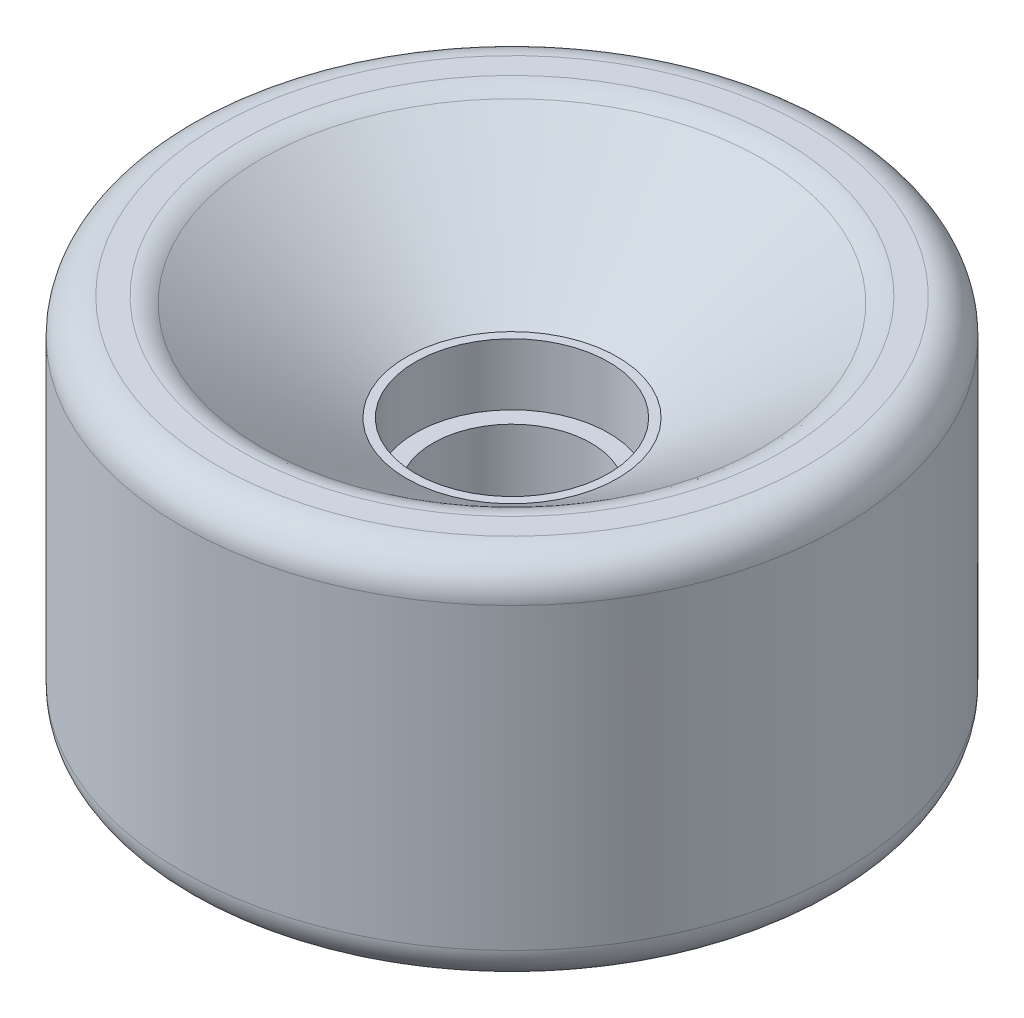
ISO-10303-21;
HEADER;
FILE_DESCRIPTION(('STEP AP214'),'2;1');
FILE_NAME('part.step','',(''),(''),'','','');
FILE_SCHEMA(('AUTOMOTIVE_DESIGN { 1 0 10303 214 1 1 1 1 }'));
ENDSEC;
DATA;
#1=APPLICATION_CONTEXT('core data for automotive mechanical design processes');
#2=APPLICATION_PROTOCOL_DEFINITION('international standard','automotive_design',2000,#1);
#3=PRODUCT_CONTEXT('',#1,'mechanical');
#4=PRODUCT('Part','Part','',(#3));
#5=PRODUCT_RELATED_PRODUCT_CATEGORY('part','',(#4));
#6=PRODUCT_DEFINITION_FORMATION('','',#4);
#7=PRODUCT_DEFINITION_CONTEXT('part definition',#1,'design');
#8=PRODUCT_DEFINITION('design','',#6,#7);
#9=PRODUCT_DEFINITION_SHAPE('','',#8);
#10=(LENGTH_UNIT() NAMED_UNIT(*) SI_UNIT(.MILLI.,.METRE.));
#11=(NAMED_UNIT(*) PLANE_ANGLE_UNIT() SI_UNIT($,.RADIAN.));
#12=(NAMED_UNIT(*) SI_UNIT($,.STERADIAN.) SOLID_ANGLE_UNIT());
#13=UNCERTAINTY_MEASURE_WITH_UNIT(LENGTH_MEASURE(1.E-05),#10,'distance_accuracy_value','');
#14=(GEOMETRIC_REPRESENTATION_CONTEXT(3) GLOBAL_UNCERTAINTY_ASSIGNED_CONTEXT((#13)) GLOBAL_UNIT_ASSIGNED_CONTEXT((#10,
#11,#12)) REPRESENTATION_CONTEXT('',''));
#15=CARTESIAN_POINT('',(0.,0.,0.));
#16=DIRECTION('',(0.,0.,1.));
#17=DIRECTION('',(1.,0.,0.));
#18=AXIS2_PLACEMENT_3D('',#15,#16,#17);
#19=CARTESIAN_POINT('',(9.,2.,0.));
#20=DIRECTION('',(0.,-1.,0.));
#21=DIRECTION('',(0.,0.,-1.));
#22=AXIS2_PLACEMENT_3D('',#19,#20,#21);
#23=PLANE('',#22);
#24=CARTESIAN_POINT('',(0.,2.,0.));
#25=DIRECTION('',(0.,1.,0.));
#26=DIRECTION('',(0.,0.,1.));
#27=AXIS2_PLACEMENT_3D('',#24,#25,#26);
#28=CIRCLE('',#27,8.99999999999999);
#29=CARTESIAN_POINT('',(0.,2.,8.99999999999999));
#30=VERTEX_POINT('',#29);
#31=EDGE_CURVE('E64',#30,#30,#28,.T.);
#32=ORIENTED_EDGE('',*,*,#31,.F.);
#33=EDGE_LOOP('',(#32));
#34=FACE_BOUND('',#33,.T.);
#35=CARTESIAN_POINT('',(0.,2.,0.));
#36=DIRECTION('',(0.,1.,0.));
#37=DIRECTION('',(0.,0.,1.));
#38=AXIS2_PLACEMENT_3D('',#35,#36,#37);
#39=CIRCLE('',#38,11.);
#40=CARTESIAN_POINT('',(0.,2.,11.));
#41=VERTEX_POINT('',#40);
#42=EDGE_CURVE('E85',#41,#41,#39,.T.);
#43=ORIENTED_EDGE('',*,*,#42,.T.);
#44=EDGE_LOOP('',(#43));
#45=FACE_BOUND('',#44,.T.);
#46=ADVANCED_FACE('F32',(#34,#45),#23,.F.);
#47=CARTESIAN_POINT('',(0.,21.,0.));
#48=DIRECTION('',(0.,1.,0.));
#49=DIRECTION('',(0.,0.,1.));
#50=AXIS2_PLACEMENT_3D('',#47,#48,#49);
#51=CYLINDRICAL_SURFACE('',#50,8.99999999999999);
#52=CARTESIAN_POINT('',(0.,-8.,0.));
#53=DIRECTION('',(0.,1.,0.));
#54=DIRECTION('',(0.,0.,1.));
#55=AXIS2_PLACEMENT_3D('',#52,#53,#54);
#56=CIRCLE('',#55,9.);
#57=CARTESIAN_POINT('',(0.,-8.,9.));
#58=VERTEX_POINT('',#57);
#59=EDGE_CURVE('E67',#58,#58,#56,.T.);
#60=ORIENTED_EDGE('',*,*,#59,.F.);
#61=EDGE_LOOP('',(#60));
#62=FACE_BOUND('',#61,.T.);
#63=ORIENTED_EDGE('',*,*,#31,.T.);
#64=EDGE_LOOP('',(#63));
#65=FACE_BOUND('',#64,.T.);
#66=ADVANCED_FACE('F115',(#62,#65),#51,.F.);
#67=CARTESIAN_POINT('',(9.,-8.,0.));
#68=DIRECTION('',(0.,1.,0.));
#69=DIRECTION('',(0.,0.,1.));
#70=AXIS2_PLACEMENT_3D('',#67,#68,#69);
#71=PLANE('',#70);
#72=CARTESIAN_POINT('',(0.,-8.,0.));
#73=DIRECTION('',(0.,1.,0.));
#74=DIRECTION('',(0.,0.,1.));
#75=AXIS2_PLACEMENT_3D('',#72,#73,#74);
#76=CIRCLE('',#75,11.);
#77=CARTESIAN_POINT('',(0.,-8.,11.));
#78=VERTEX_POINT('',#77);
#79=EDGE_CURVE('E70',#78,#78,#76,.T.);
#80=ORIENTED_EDGE('',*,*,#79,.F.);
#81=EDGE_LOOP('',(#80));
#82=FACE_BOUND('',#81,.T.);
#83=ORIENTED_EDGE('',*,*,#59,.T.);
#84=EDGE_LOOP('',(#83));
#85=FACE_BOUND('',#84,.T.);
#86=ADVANCED_FACE('F121',(#82,#85),#71,.F.);
#87=CARTESIAN_POINT('',(0.,21.,0.));
#88=DIRECTION('',(0.,1.,0.));
#89=DIRECTION('',(0.,0.,1.));
#90=AXIS2_PLACEMENT_3D('',#87,#88,#89);
#91=CYLINDRICAL_SURFACE('',#90,11.);
#92=CARTESIAN_POINT('',(0.,-15.,0.));
#93=DIRECTION('',(0.,1.,0.));
#94=DIRECTION('',(0.,0.,1.));
#95=AXIS2_PLACEMENT_3D('',#92,#93,#94);
#96=CIRCLE('',#95,11.);
#97=CARTESIAN_POINT('',(0.,-15.,11.));
#98=VERTEX_POINT('',#97);
#99=EDGE_CURVE('E73',#98,#98,#96,.T.);
#100=ORIENTED_EDGE('',*,*,#99,.F.);
#101=EDGE_LOOP('',(#100));
#102=FACE_BOUND('',#101,.T.);
#103=ORIENTED_EDGE('',*,*,#79,.T.);
#104=EDGE_LOOP('',(#103));
#105=FACE_BOUND('',#104,.T.);
#106=ADVANCED_FACE('F159',(#102,#105),#91,.F.);
#107=CARTESIAN_POINT('',(11.,-15.,0.));
#108=DIRECTION('',(0.,1.,0.));
#109=DIRECTION('',(0.,0.,1.));
#110=AXIS2_PLACEMENT_3D('',#107,#108,#109);
#111=PLANE('',#110);
#112=CARTESIAN_POINT('',(0.,-15.,0.));
#113=DIRECTION('',(0.,1.,0.));
#114=DIRECTION('',(0.,0.,1.));
#115=AXIS2_PLACEMENT_3D('',#112,#113,#114);
#116=CIRCLE('',#115,12.);
#117=CARTESIAN_POINT('',(0.,-15.,12.));
#118=VERTEX_POINT('',#117);
#119=EDGE_CURVE('E76',#118,#118,#116,.T.);
#120=ORIENTED_EDGE('',*,*,#119,.F.);
#121=EDGE_LOOP('',(#120));
#122=FACE_BOUND('',#121,.T.);
#123=ORIENTED_EDGE('',*,*,#99,.T.);
#124=EDGE_LOOP('',(#123));
#125=FACE_BOUND('',#124,.T.);
#126=ADVANCED_FACE('F153',(#122,#125),#111,.F.);
#127=CARTESIAN_POINT('',(0.,-15.,0.));
#128=DIRECTION('',(0.,-1.,0.));
#129=DIRECTION('',(0.,0.,-1.));
#130=AXIS2_PLACEMENT_3D('',#127,#128,#129);
#131=CONICAL_SURFACE('',#130,12.,1.24049897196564);
#132=CARTESIAN_POINT('',(0.,-20.7837837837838,0.));
#133=DIRECTION('',(0.,1.,0.));
#134=DIRECTION('',(0.,0.,1.));
#135=AXIS2_PLACEMENT_3D('',#132,#133,#134);
#136=CIRCLE('',#135,28.8693693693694);
#137=CARTESIAN_POINT('',(0.,-20.7837837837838,28.8693693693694));
#138=VERTEX_POINT('',#137);
#139=EDGE_CURVE('E55',#138,#138,#136,.F.);
#140=ORIENTED_EDGE('',*,*,#139,.T.);
#141=EDGE_LOOP('',(#140));
#142=FACE_BOUND('',#141,.T.);
#143=ORIENTED_EDGE('',*,*,#119,.T.);
#144=EDGE_LOOP('',(#143));
#145=FACE_BOUND('',#144,.T.);
#146=ADVANCED_FACE('F145',(#142,#145),#131,.F.);
#147=CARTESIAN_POINT('',(29.5,-21.,0.));
#148=DIRECTION('',(0.,1.,0.));
#149=DIRECTION('',(0.,0.,1.));
#150=AXIS2_PLACEMENT_3D('',#147,#148,#149);
#151=PLANE('',#150);
#152=CARTESIAN_POINT('',(0.,-21.,0.));
#153=DIRECTION('',(0.,1.,0.));
#154=DIRECTION('',(0.,0.,1.));
#155=AXIS2_PLACEMENT_3D('',#152,#153,#154);
#156=CIRCLE('',#155,30.1666666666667);
#157=CARTESIAN_POINT('',(0.,-21.,30.1666666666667));
#158=VERTEX_POINT('',#157);
#159=EDGE_CURVE('E58',#158,#158,#156,.T.);
#160=ORIENTED_EDGE('',*,*,#159,.T.);
#161=EDGE_LOOP('',(#160));
#162=FACE_BOUND('',#161,.T.);
#163=CARTESIAN_POINT('',(0.,-21.,0.));
#164=DIRECTION('',(0.,1.,0.));
#165=DIRECTION('',(0.,0.,1.));
#166=AXIS2_PLACEMENT_3D('',#163,#164,#165);
#167=CIRCLE('',#166,33.5);
#168=CARTESIAN_POINT('',(0.,-21.,33.5));
#169=VERTEX_POINT('',#168);
#170=EDGE_CURVE('E61',#169,#169,#167,.F.);
#171=ORIENTED_EDGE('',*,*,#170,.T.);
#172=EDGE_LOOP('',(#171));
#173=FACE_BOUND('',#172,.T.);
#174=ADVANCED_FACE('F143',(#162,#173),#151,.F.);
#175=CARTESIAN_POINT('',(0.,21.,0.));
#176=DIRECTION('',(0.,1.,0.));
#177=DIRECTION('',(0.,0.,1.));
#178=AXIS2_PLACEMENT_3D('',#175,#176,#177);
#179=CYLINDRICAL_SURFACE('',#178,37.5);
#180=CARTESIAN_POINT('',(0.,-17.,0.));
#181=DIRECTION('',(0.,1.,0.));
#182=DIRECTION('',(0.,0.,1.));
#183=AXIS2_PLACEMENT_3D('',#180,#181,#182);
#184=CIRCLE('',#183,37.5);
#185=CARTESIAN_POINT('',(0.,-17.,37.5));
#186=VERTEX_POINT('',#185);
#187=EDGE_CURVE('E10',#186,#186,#184,.T.);
#188=ORIENTED_EDGE('',*,*,#187,.T.);
#189=EDGE_LOOP('',(#188));
#190=FACE_BOUND('',#189,.T.);
#191=CARTESIAN_POINT('',(0.,17.,0.));
#192=DIRECTION('',(0.,-1.,0.));
#193=DIRECTION('',(0.,0.,-1.));
#194=AXIS2_PLACEMENT_3D('',#191,#192,#193);
#195=CIRCLE('',#194,37.5);
#196=CARTESIAN_POINT('',(0.,17.,-37.5));
#197=VERTEX_POINT('',#196);
#198=EDGE_CURVE('E39',#197,#197,#195,.T.);
#199=ORIENTED_EDGE('',*,*,#198,.T.);
#200=EDGE_LOOP('',(#199));
#201=FACE_BOUND('',#200,.T.);
#202=ADVANCED_FACE('F111',(#190,#201),#179,.T.);
#203=CARTESIAN_POINT('',(37.5,21.,0.));
#204=DIRECTION('',(0.,-1.,0.));
#205=DIRECTION('',(0.,0.,-1.));
#206=AXIS2_PLACEMENT_3D('',#203,#204,#205);
#207=PLANE('',#206);
#208=CARTESIAN_POINT('',(0.,21.,0.));
#209=DIRECTION('',(0.,-1.,0.));
#210=DIRECTION('',(0.,0.,-1.));
#211=AXIS2_PLACEMENT_3D('',#208,#209,#210);
#212=CIRCLE('',#211,30.7396983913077);
#213=CARTESIAN_POINT('',(0.,21.,-30.7396983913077));
#214=VERTEX_POINT('',#213);
#215=EDGE_CURVE('E43',#214,#214,#212,.T.);
#216=ORIENTED_EDGE('',*,*,#215,.T.);
#217=EDGE_LOOP('',(#216));
#218=FACE_BOUND('',#217,.T.);
#219=CARTESIAN_POINT('',(0.,21.,0.));
#220=DIRECTION('',(0.,-1.,0.));
#221=DIRECTION('',(0.,0.,-1.));
#222=AXIS2_PLACEMENT_3D('',#219,#220,#221);
#223=CIRCLE('',#222,33.5);
#224=CARTESIAN_POINT('',(0.,21.,-33.5));
#225=VERTEX_POINT('',#224);
#226=EDGE_CURVE('E47',#225,#225,#223,.F.);
#227=ORIENTED_EDGE('',*,*,#226,.T.);
#228=EDGE_LOOP('',(#227));
#229=FACE_BOUND('',#228,.T.);
#230=ADVANCED_FACE('F105',(#218,#229),#207,.F.);
#231=CARTESIAN_POINT('',(0.,21.,0.));
#232=DIRECTION('',(0.,1.,0.));
#233=DIRECTION('',(0.,0.,1.));
#234=AXIS2_PLACEMENT_3D('',#231,#232,#233);
#235=CONICAL_SURFACE('',#234,29.5,0.969722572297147);
#236=CARTESIAN_POINT('',(0.,20.2989154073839,0.));
#237=DIRECTION('',(0.,-1.,0.));
#238=DIRECTION('',(0.,0.,-1.));
#239=AXIS2_PLACEMENT_3D('',#236,#237,#238);
#240=CIRCLE('',#239,28.4775849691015);
#241=CARTESIAN_POINT('',(0.,20.2989154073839,-28.4775849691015));
#242=VERTEX_POINT('',#241);
#243=EDGE_CURVE('E52',#242,#242,#240,.F.);
#244=ORIENTED_EDGE('',*,*,#243,.T.);
#245=EDGE_LOOP('',(#244));
#246=FACE_BOUND('',#245,.T.);
#247=CARTESIAN_POINT('',(0.,9.,0.));
#248=DIRECTION('',(0.,1.,0.));
#249=DIRECTION('',(0.,0.,1.));
#250=AXIS2_PLACEMENT_3D('',#247,#248,#249);
#251=CIRCLE('',#250,12.);
#252=CARTESIAN_POINT('',(0.,9.,12.));
#253=VERTEX_POINT('',#252);
#254=EDGE_CURVE('E79',#253,#253,#251,.T.);
#255=ORIENTED_EDGE('',*,*,#254,.F.);
#256=EDGE_LOOP('',(#255));
#257=FACE_BOUND('',#256,.T.);
#258=ADVANCED_FACE('F100',(#246,#257),#235,.F.);
#259=CARTESIAN_POINT('',(11.,9.,0.));
#260=DIRECTION('',(0.,-1.,0.));
#261=DIRECTION('',(0.,0.,-1.));
#262=AXIS2_PLACEMENT_3D('',#259,#260,#261);
#263=PLANE('',#262);
#264=CARTESIAN_POINT('',(0.,9.,0.));
#265=DIRECTION('',(0.,1.,0.));
#266=DIRECTION('',(0.,0.,1.));
#267=AXIS2_PLACEMENT_3D('',#264,#265,#266);
#268=CIRCLE('',#267,11.);
#269=CARTESIAN_POINT('',(0.,9.,11.));
#270=VERTEX_POINT('',#269);
#271=EDGE_CURVE('E82',#270,#270,#268,.T.);
#272=ORIENTED_EDGE('',*,*,#271,.F.);
#273=EDGE_LOOP('',(#272));
#274=FACE_BOUND('',#273,.T.);
#275=ORIENTED_EDGE('',*,*,#254,.T.);
#276=EDGE_LOOP('',(#275));
#277=FACE_BOUND('',#276,.T.);
#278=ADVANCED_FACE('F94',(#274,#277),#263,.F.);
#279=CARTESIAN_POINT('',(0.,21.,0.));
#280=DIRECTION('',(0.,1.,0.));
#281=DIRECTION('',(0.,0.,1.));
#282=AXIS2_PLACEMENT_3D('',#279,#280,#281);
#283=CYLINDRICAL_SURFACE('',#282,11.);
#284=ORIENTED_EDGE('',*,*,#42,.F.);
#285=EDGE_LOOP('',(#284));
#286=FACE_BOUND('',#285,.T.);
#287=ORIENTED_EDGE('',*,*,#271,.T.);
#288=EDGE_LOOP('',(#287));
#289=FACE_BOUND('',#288,.T.);
#290=ADVANCED_FACE('F90',(#286,#289),#283,.F.);
#291=CARTESIAN_POINT('',(0.,-17.,0.));
#292=DIRECTION('',(0.,1.,0.));
#293=DIRECTION('',(0.,0.,1.));
#294=AXIS2_PLACEMENT_3D('',#291,#292,#293);
#295=TOROIDAL_SURFACE('',#294,30.1666666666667,4.);
#296=ORIENTED_EDGE('',*,*,#139,.F.);
#297=EDGE_LOOP('',(#296));
#298=FACE_BOUND('',#297,.T.);
#299=ORIENTED_EDGE('',*,*,#159,.F.);
#300=EDGE_LOOP('',(#299));
#301=FACE_BOUND('',#300,.T.);
#302=ADVANCED_FACE('F93',(#298,#301),#295,.T.);
#303=CARTESIAN_POINT('',(0.,17.,0.));
#304=DIRECTION('',(0.,-1.,0.));
#305=DIRECTION('',(0.,0.,-1.));
#306=AXIS2_PLACEMENT_3D('',#303,#304,#305);
#307=TOROIDAL_SURFACE('',#306,30.7396983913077,4.);
#308=ORIENTED_EDGE('',*,*,#215,.F.);
#309=EDGE_LOOP('',(#308));
#310=FACE_BOUND('',#309,.T.);
#311=ORIENTED_EDGE('',*,*,#243,.F.);
#312=EDGE_LOOP('',(#311));
#313=FACE_BOUND('',#312,.T.);
#314=ADVANCED_FACE('F129',(#310,#313),#307,.T.);
#315=CARTESIAN_POINT('',(0.,-17.,0.));
#316=DIRECTION('',(0.,1.,0.));
#317=DIRECTION('',(0.,0.,1.));
#318=AXIS2_PLACEMENT_3D('',#315,#316,#317);
#319=TOROIDAL_SURFACE('',#318,33.5,4.);
#320=ORIENTED_EDGE('',*,*,#170,.F.);
#321=EDGE_LOOP('',(#320));
#322=FACE_BOUND('',#321,.T.);
#323=ORIENTED_EDGE('',*,*,#187,.F.);
#324=EDGE_LOOP('',(#323));
#325=FACE_BOUND('',#324,.T.);
#326=ADVANCED_FACE('F132',(#322,#325),#319,.T.);
#327=CARTESIAN_POINT('',(0.,17.,0.));
#328=DIRECTION('',(0.,-1.,0.));
#329=DIRECTION('',(0.,0.,-1.));
#330=AXIS2_PLACEMENT_3D('',#327,#328,#329);
#331=TOROIDAL_SURFACE('',#330,33.5,4.);
#332=ORIENTED_EDGE('',*,*,#198,.F.);
#333=EDGE_LOOP('',(#332));
#334=FACE_BOUND('',#333,.T.);
#335=ORIENTED_EDGE('',*,*,#226,.F.);
#336=EDGE_LOOP('',(#335));
#337=FACE_BOUND('',#336,.T.);
#338=ADVANCED_FACE('F34',(#334,#337),#331,.T.);
#339=CLOSED_SHELL('',(#46,#66,#86,#106,#126,#146,#174,#202,#230,#258,#278,#290,#302,#314,#326,#338));
#340=MANIFOLD_SOLID_BREP('B2',#339);
#341=ADVANCED_BREP_SHAPE_REPRESENTATION('',(#18,#340),#14);
#342=SHAPE_DEFINITION_REPRESENTATION(#9,#341);
ENDSEC;
END-ISO-10303-21;
